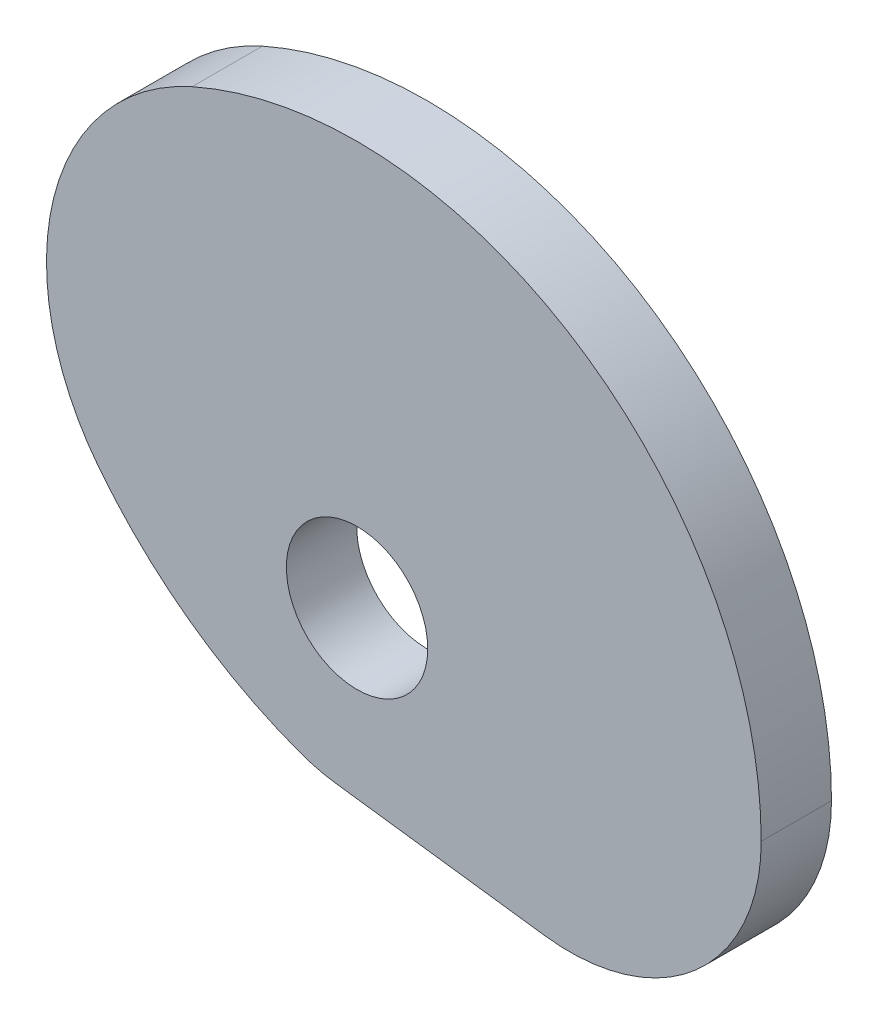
from build123d import *

# Parameters (mm, degrees)
ESQUISSE1_R      = 20.110417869
EXTRUSION1_DEPTH = 10


with BuildPart() as part:
    # Esquisse1 → Extrusion1 (new, symmetric)
    with BuildSketch(Plane.XY):
        with BuildLine():
            Line((-6.061365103, -46.239410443), (53.416584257, -54.036170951))
            ThreePointArc((53.416584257, -54.036170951), (96.444730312, -40.964117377), (114.998463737, 1.5e-08))
            ThreePointArc((114.998463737, 1.5e-08), (62.554308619, 96.496658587), (-46.944658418, 104.98021558))
            ThreePointArc((-46.944658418, 104.98021558), (-86.333984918, 57.832474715), (-73.368543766, -2.220217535))
            ThreePointArc((-73.368543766, -2.220217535), (-47.589818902, -26.997189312), (-16.025943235, -43.794889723))
            ThreePointArc((-16.025943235, -43.794889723), (-11.111085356, -45.29201923), (-6.061365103, -46.239410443))
        make_face()
        with Locations((1.27e-07, -1.7e-08)):
            Circle(ESQUISSE1_R, mode=Mode.SUBTRACT)
    extrude(amount=EXTRUSION1_DEPTH, both=True)


solid = part.part
